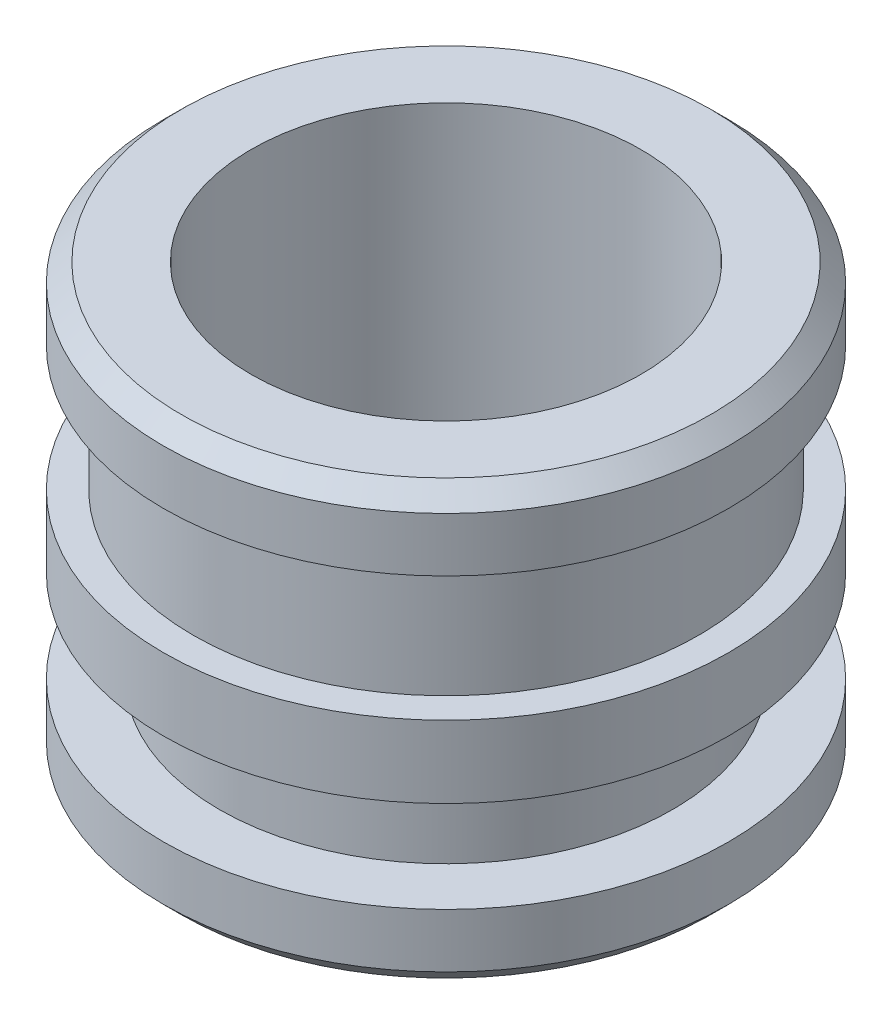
from build123d import *

# Parameters (mm, degrees)
M2_5X0_45_TAPPED_HOLE1_D     = 2.05
M2_5X0_45_TAPPED_HOLE1_DEPTH = 4.2
CHAMFER1_SIZE                = 0.25
SKETCH7_R                    = 2.7
CUT_EXTRUDE1_DEPTH           = 4.5


with BuildPart() as part:
    # Sketch1 → Revolve1 (revolve)
    with BuildSketch(Plane.XY, mode=Mode.PRIVATE) as revolve1_sk:
        Polygon((3.915, 2.27), (3.915, 3.27), (3.5, 3.27), (3.5, 5), (3.915, 5), (3.915, 6), (0, 6), (0, 0), (3.915, 0), (3.915, 1), (3.14, 1), (3.14, 2.27), align=None)
    revolve(revolve1_sk.sketch.rotate(Axis((0, 11.048100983, 0), (0, -1, 0)), 90), axis=Axis((0, 11.048100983, 0), (0, -1, 0)))

    # M2.5x0.45 Tapped Hole1
    with Locations(Plane(origin=(0, 6, 0), x_dir=(1, 0, 0), z_dir=(0, 1, 0))):
        with Locations((0, 0)):
            Hole(M2_5X0_45_TAPPED_HOLE1_D / 2, depth=M2_5X0_45_TAPPED_HOLE1_DEPTH)

    # Chamfer1
    chamfer1_edges = [part.edges().sort_by_distance(p)[0] for p in [
        (0, 0, -3.915),
        (0, 6, -3.915),
    ]]
    chamfer(chamfer1_edges, length=CHAMFER1_SIZE)

    # Sketch7 → Cut-Extrude1 (cut)
    with BuildSketch(Plane(origin=(0, 6, 0), x_dir=(1, 0, 0), z_dir=(0, 1, 0))):
        with Locations(Location((0, 0, 0), (0, 0, 270))):
            Circle(SKETCH7_R)
    extrude(amount=-CUT_EXTRUDE1_DEPTH, mode=Mode.SUBTRACT)


solid = part.part
